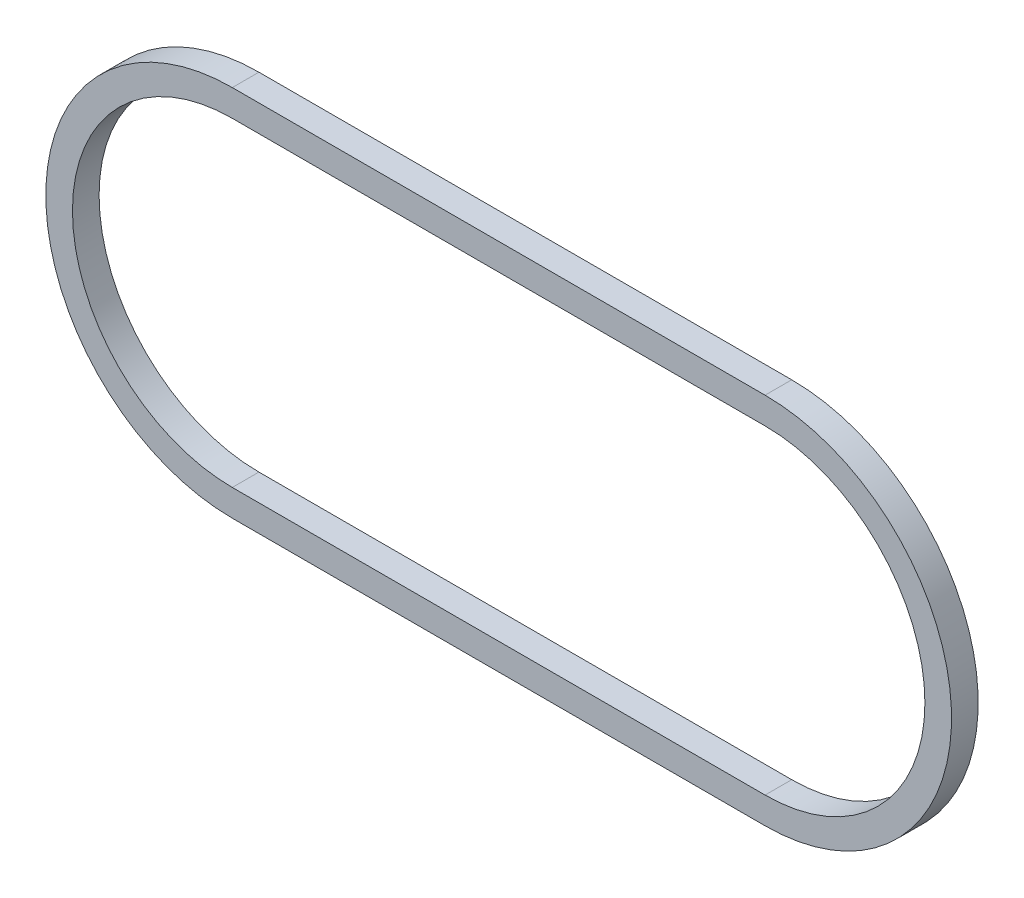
from build123d import *

# Parameters (mm, degrees)
BOSS_EXTRUDE1_DEPTH = 3.175


with BuildPart() as part:
    # Sketch1 → Boss-Extrude1 (new, symmetric)
    with BuildSketch(Plane.XY):
        with BuildLine():
            Line((-63.5, 44.45), (63.5, 44.45))
            ThreePointArc((63.5, 44.45), (107.95, 0), (63.5, -44.45))
            Line((63.5, -44.45), (-63.5, -44.45))
            ThreePointArc((-63.5, -44.45), (-107.95, 0), (-63.5, 44.45))
        make_face()
        with BuildLine():
            Line((-63.5, 38.1), (63.5, 38.1))
            ThreePointArc((63.5, 38.1), (101.6, 0), (63.5, -38.1))
            Line((63.5, -38.1), (-63.5, -38.1))
            ThreePointArc((-63.5, -38.1), (-101.6, 0), (-63.5, 38.1))
        make_face(mode=Mode.SUBTRACT)
    extrude(amount=BOSS_EXTRUDE1_DEPTH, both=True)


solid = part.part
